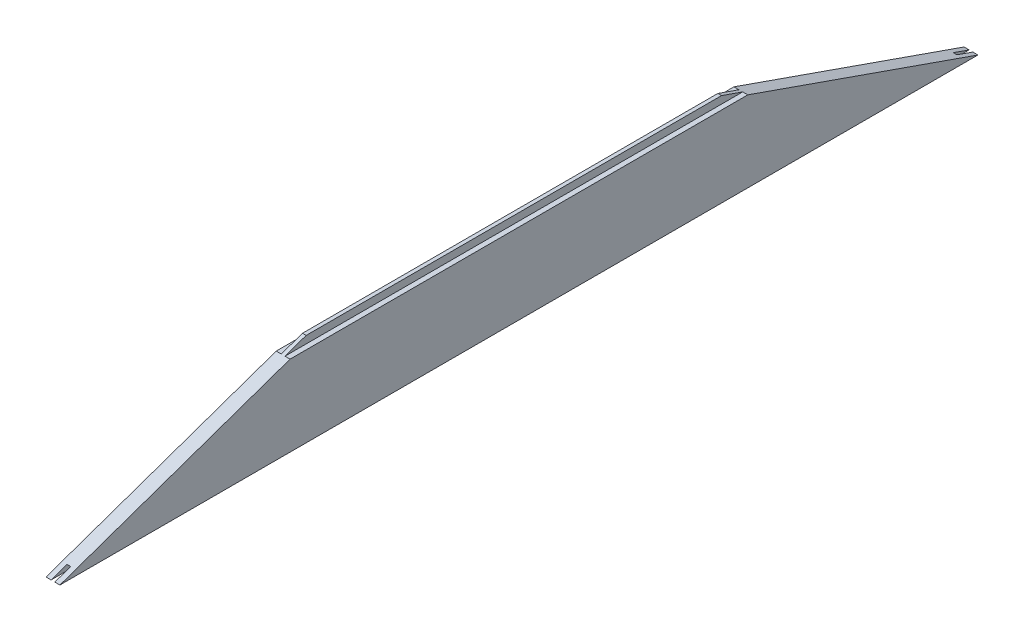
from build123d import *

# Parameters (mm, degrees)
ESQUISSE1_W                  = 4
ESQUISSE1_H                  = 8
BOSS_EXTRU_1_DEPTH           = 991.4
ENL_V_MAT_EXTRU_1_DEPTH      = 993.765057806
ENL_V_MAT_EXTRU_1_DEPTH_BACK = 993.765057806


with BuildPart() as part:
    # Esquisse1 → Boss.-Extru.1 (new body)
    with BuildSketch(Plane.XY):
        with Locations((0, 47.5)):
            Rectangle(ESQUISSE1_W, ESQUISSE1_H)
        with Locations((0, 39.5)):
            Rectangle(ESQUISSE1_W, ESQUISSE1_H)
        Polygon((-2, 43.5), (-7.5, 43.5), (-7.5, -43.5), (-2, -43.5), (-2, -37.5), (2, -37.5), (2, -43.5), (7.5, -43.5), (7.5, 43.5), (2, 43.5), (2, 35.5), (-2, 35.5), align=None)
    extrude(amount=BOSS_EXTRU_1_DEPTH)

    # Esquisse2 → Enl_v. mat.-Extru.1 (cut, two sides: drawn at the far end of the back side and taken through both)
    with BuildSketch(Plane(origin=(0, 0, 0), x_dir=(0, 0, -1), z_dir=(1, 0, 0)).offset(-ENL_V_MAT_EXTRU_1_DEPTH_BACK)):
        Polygon((-991.4, -43.5), (-719.970726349, 51.5), (-991.4, 51.5), align=None)
        Polygon((0, -43.5), (-271.429273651, 51.5), (0, 51.5), align=None)
    extrude(amount=ENL_V_MAT_EXTRU_1_DEPTH + ENL_V_MAT_EXTRU_1_DEPTH_BACK, mode=Mode.SUBTRACT)


solid = part.part
